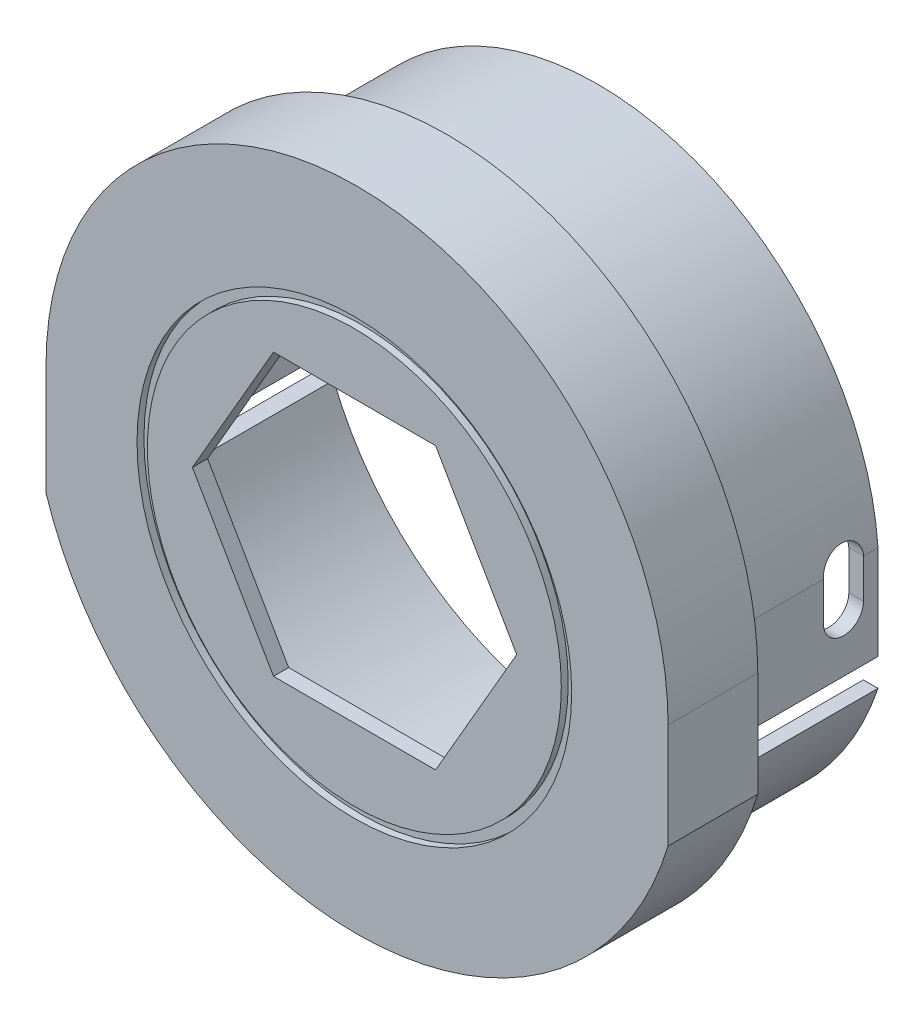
from build123d import *

# Parameters (mm, degrees)
EXTRUDE_1_DEPTH      = 1.5
CUT_EXTRUDE_1_DEPTH  = 1.5
SKETCH_11_R          = 15.75
SKETCH_11_R_2        = 15
CUT_EXTRUDE_12_DEPTH = 0.5
EXTRUDE_2_DEPTH      = 16
EXTRUDE_START        = 5
EXTRUDE_3_DEPTH      = 5
SKETCH_22_W          = 1.063482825
SKETCH_22_H          = 2
SKETCH_22_W_2        = 1.195600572
CUT_EXTRUDE_13_DEPTH = 11
CUT_EXTRUDE_14_DEPTH = 3
SKETCH_24_R          = 1.45
CUT_EXTRUDE_15_DEPTH = 3
CUT_EXTRUDE_16_DEPTH = 0.4
CUT_EXTRUDE_17_DEPTH = 1.15


with BuildPart() as part:
    # Sketch 1 → Extrude 1 (new body)
    with BuildSketch(Plane.XY):
        with BuildLine():
            Line((-23.220661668, -1.26250342), (-23.220661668, -9.246225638))
            ThreePointArc((-23.220661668, -9.246225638), (-0.538109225, -25.664361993), (21.861194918, -8.861845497))
            Line((21.861194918, -8.861845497), (21.861194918, -1.26250342))
            ThreePointArc((21.861194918, -1.26250342), (-0.679733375, 21.278424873), (-23.220661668, -1.26250342))
        make_face()
    extrude(amount=EXTRUDE_1_DEPTH)

    # Sketch 2 → Cut-Extrude 1 (cut)
    with BuildSketch(Plane(origin=(0, 0, 0), x_dir=(-1, 0, 0), z_dir=(0, 0, -1))):
        Polygon((-10.889953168, -2.337394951), (-5.014953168, -12.513193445), (6.735046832, -12.513193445), (12.610046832, -2.337394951), (6.735046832, 7.838403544), (-5.014953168, 7.838403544), align=None)
    extrude(amount=-CUT_EXTRUDE_1_DEPTH, mode=Mode.SUBTRACT)

    # Sketch 11 → Cut-Extrude 12 (cut)
    with BuildSketch(Plane.XY.offset(1.5)):
        with Locations((-0.874749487, -2.749380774)):
            Circle(SKETCH_11_R)
        with Locations((-0.874749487, -2.749380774)):
            Circle(SKETCH_11_R_2, mode=Mode.SUBTRACT)
    extrude(amount=-CUT_EXTRUDE_12_DEPTH, mode=Mode.SUBTRACT)

    # Sketch 20 → Extrude 2 (add)
    with BuildSketch(Plane(origin=(0, 0, 0), x_dir=(-1, 0, 0), z_dir=(0, 0, -1))):
        with BuildLine():
            Line((-19.574677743, -0.032493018), (-19.574677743, -8.861845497))
            ThreePointArc((-19.574677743, -8.861845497), (0.608296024, -23.575149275), (21.06595194, -9.246225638))
            Line((21.06595194, -9.246225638), (21.06595194, -0.384380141))
            ThreePointArc((21.06595194, -0.384380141), (0.91109376, 18.900710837), (-19.574677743, -0.032493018))
        make_face()
        with BuildLine():
            Line((-18.511194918, -8.861845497), (-18.511194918, -0.032493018))
            ThreePointArc((-18.511194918, -0.032493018), (0.843970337, 17.722380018), (19.870351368, -0.384380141))
            Line((19.870351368, -0.384380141), (19.870351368, -9.246225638))
            ThreePointArc((19.870351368, -9.246225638), (0.547739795, -22.21851067), (-18.511194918, -8.861845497))
        make_face(mode=Mode.SUBTRACT)
    extrude(amount=EXTRUDE_2_DEPTH)

    # Sketch 21 → Extrude 3 (add)
    with BuildSketch(Plane(origin=(0, 0, 0), x_dir=(-1, 0, 0), z_dir=(0, 0, -1)).offset(EXTRUDE_START)):
        with BuildLine():
            Line((-21.861194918, -1.26250342), (-21.861194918, -8.861845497))
            ThreePointArc((-21.861194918, -8.861845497), (0.538109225, -25.664361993), (23.220661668, -9.246225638))
            Line((23.220661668, -9.246225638), (23.220661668, -1.26250342))
            ThreePointArc((23.220661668, -1.26250342), (0.679733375, 21.278424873), (-21.861194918, -1.26250342))
        make_face()
        with BuildLine():
            Line((-21.244238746, -8.861845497), (-21.244238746, -1.26250342))
            ThreePointArc((-21.244238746, -1.26250342), (0.591861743, 20.11714502), (22.427962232, -1.26250342))
            Line((22.427962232, -1.26250342), (22.427962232, -9.246225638))
            ThreePointArc((22.427962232, -9.246225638), (0.454478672, -24.66311747), (-21.244238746, -8.861845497))
        make_face(mode=Mode.SUBTRACT)
    extrude(amount=-EXTRUDE_3_DEPTH)

    # Sketch 22 → Cut-Extrude 13 (cut)
    with BuildSketch(Plane(origin=(0, 0, -16), x_dir=(-1, 0, 0), z_dir=(0, 0, -1))):
        with Locations((-19.042936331, -7.861845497)):
            Rectangle(SKETCH_22_W, SKETCH_22_H)
        with Locations((20.468151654, -8.246225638)):
            Rectangle(SKETCH_22_W_2, SKETCH_22_H)
    extrude(amount=-CUT_EXTRUDE_13_DEPTH, mode=Mode.SUBTRACT)

    # Sketch 23 → Cut-Extrude 14 (cut)
    with BuildSketch(Plane(origin=(19.574677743, 0, 0), x_dir=(0, 0, -1), z_dir=(1, 0, 0))):
        with BuildLine():
            Line((12.05, -0.032493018), (12.05, -2.861845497))
            ThreePointArc((12.05, -2.861845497), (13.5, -4.311845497), (14.95, -2.861845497))
            Line((14.95, -2.861845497), (14.95, -0.032493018))
            ThreePointArc((14.95, -0.032493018), (13.5, 1.417506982), (12.05, -0.032493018))
        make_face()
    extrude(amount=-CUT_EXTRUDE_14_DEPTH, mode=Mode.SUBTRACT)

    # Sketch 24 → Cut-Extrude 15 (cut)
    with BuildSketch(Plane.ZY.offset(21.06595194)):
        with Locations(Location((-13.5, -1.246225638, 0), (0, 0, 36.468175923))):
            Circle(SKETCH_24_R)
    extrude(amount=-CUT_EXTRUDE_15_DEPTH, mode=Mode.SUBTRACT)

    # Sketch 25 → Cut-Extrude 16 (cut)
    with BuildSketch(Plane(origin=(0, 0, 0), x_dir=(-1, 0, 0), z_dir=(0, 0, -1))):
        with BuildLine():
            Line((-13.271621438, -2.633462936), (-6.729721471, 9.461340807))
            ThreePointArc((-6.729721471, 9.461340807), (0.645529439, 11.940204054), (8.124691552, 9.795157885))
            Line((8.124691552, 9.795157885), (14.742936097, -2.106090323))
            ThreePointArc((14.742936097, -2.106090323), (13.076602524, -9.434355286), (7.717327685, -14.702970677))
            Line((7.717327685, -14.702970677), (-5.884425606, -14.702970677))
            ThreePointArc((-5.884425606, -14.702970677), (-11.230459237, -9.679597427), (-13.271621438, -2.633462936))
        make_face()
    extrude(amount=-CUT_EXTRUDE_16_DEPTH, mode=Mode.SUBTRACT)

    # Sketch 26 → Cut-Extrude 17 (cut)
    with BuildSketch(Plane(origin=(0, 0, 0), x_dir=(-1, 0, 0), z_dir=(0, 0, -1))):
        with BuildLine():
            Line((-21.244238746, -1.26250342), (-21.244238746, -8.861845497))
            ThreePointArc((-21.244238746, -8.861845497), (0.454478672, -24.66311747), (22.427962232, -9.246225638))
            Line((22.427962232, -9.246225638), (22.427962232, -1.26250342))
            ThreePointArc((22.427962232, -1.26250342), (0.591861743, 20.11714502), (-21.244238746, -1.26250342))
        make_face()
        with BuildLine():
            Line((-19.574677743, -1.26250342), (-19.574677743, -8.861845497))
            ThreePointArc((-19.574677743, -8.861845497), (0.608296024, -23.575149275), (21.06595194, -9.246225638))
            Line((21.06595194, -9.246225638), (21.06595194, -1.26250342))
            ThreePointArc((21.06595194, -1.26250342), (0.745637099, 18.899923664), (-19.574677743, -1.26250342))
        make_face(mode=Mode.SUBTRACT)
    extrude(amount=-CUT_EXTRUDE_17_DEPTH, mode=Mode.SUBTRACT)


solid = part.part
